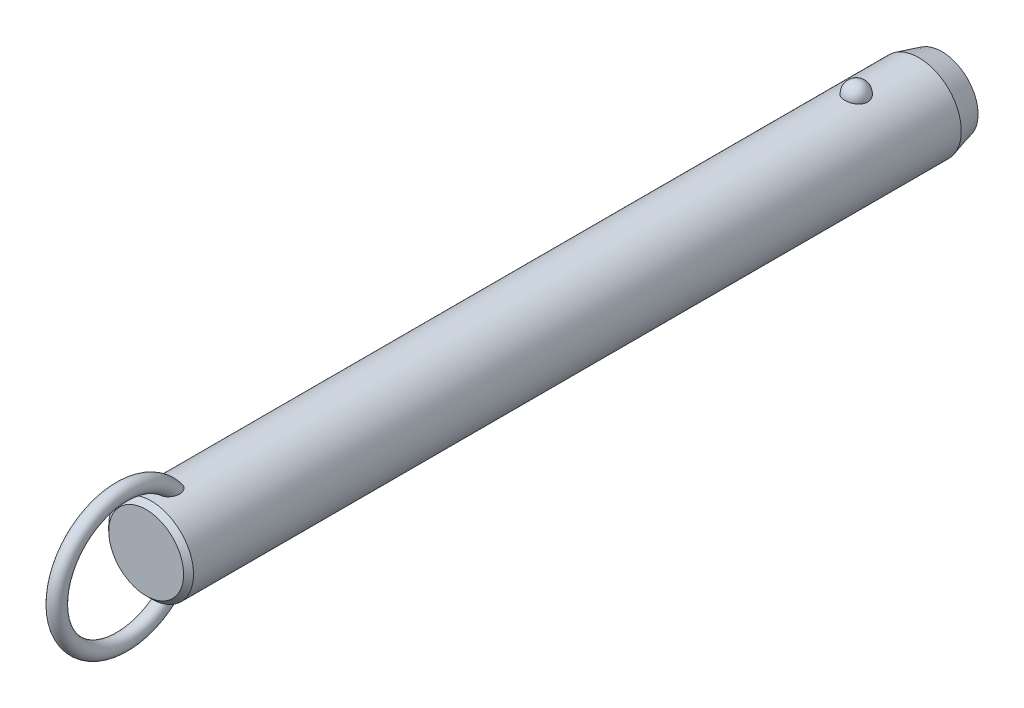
ISO-10303-21;
HEADER;
FILE_DESCRIPTION(('STEP AP214'),'2;1');
FILE_NAME('part.step','',(''),(''),'','','');
FILE_SCHEMA(('AUTOMOTIVE_DESIGN { 1 0 10303 214 1 1 1 1 }'));
ENDSEC;
DATA;
#1=APPLICATION_CONTEXT('core data for automotive mechanical design processes');
#2=APPLICATION_PROTOCOL_DEFINITION('international standard','automotive_design',2000,#1);
#3=PRODUCT_CONTEXT('',#1,'mechanical');
#4=PRODUCT('Part','Part','',(#3));
#5=PRODUCT_RELATED_PRODUCT_CATEGORY('part','',(#4));
#6=PRODUCT_DEFINITION_FORMATION('','',#4);
#7=PRODUCT_DEFINITION_CONTEXT('part definition',#1,'design');
#8=PRODUCT_DEFINITION('design','',#6,#7);
#9=PRODUCT_DEFINITION_SHAPE('','',#8);
#10=(LENGTH_UNIT() NAMED_UNIT(*) SI_UNIT(.MILLI.,.METRE.));
#11=(NAMED_UNIT(*) PLANE_ANGLE_UNIT() SI_UNIT($,.RADIAN.));
#12=(NAMED_UNIT(*) SI_UNIT($,.STERADIAN.) SOLID_ANGLE_UNIT());
#13=UNCERTAINTY_MEASURE_WITH_UNIT(LENGTH_MEASURE(1.E-05),#10,'distance_accuracy_value','');
#14=(GEOMETRIC_REPRESENTATION_CONTEXT(3) GLOBAL_UNCERTAINTY_ASSIGNED_CONTEXT((#13)) GLOBAL_UNIT_ASSIGNED_CONTEXT((#10,
#11,#12)) REPRESENTATION_CONTEXT('',''));
#15=CARTESIAN_POINT('',(0.,0.,0.));
#16=DIRECTION('',(0.,0.,1.));
#17=DIRECTION('',(1.,0.,0.));
#18=AXIS2_PLACEMENT_3D('',#15,#16,#17);
#19=CARTESIAN_POINT('',(0.,0.,170.2));
#20=DIRECTION('',(0.,0.,-1.));
#21=DIRECTION('',(-1.,0.,0.));
#22=AXIS2_PLACEMENT_3D('',#19,#20,#21);
#23=CYLINDRICAL_SURFACE('',#22,11.1);
#24=CARTESIAN_POINT('',(2.9724815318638,10.6945945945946,-3.00000000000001));
#25=CARTESIAN_POINT('',(2.97247830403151,10.6945972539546,-2.8322505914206));
#26=CARTESIAN_POINT('',(2.95876598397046,10.6984356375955,-2.66445972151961));
#27=CARTESIAN_POINT('',(2.90424529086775,10.7133624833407,-2.3336238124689));
#28=CARTESIAN_POINT('',(2.8634252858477,10.7244540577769,-2.17058084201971));
#29=CARTESIAN_POINT('',(2.75573657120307,10.7526272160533,-1.85396767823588));
#30=CARTESIAN_POINT('',(2.68887937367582,10.7697061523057,-1.70039333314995));
#31=CARTESIAN_POINT('',(2.53079696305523,10.8079438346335,-1.4069159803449));
#32=CARTESIAN_POINT('',(2.43957264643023,10.8291024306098,-1.26701246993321));
#33=CARTESIAN_POINT('',(2.23458150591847,10.8732541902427,-1.00409565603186));
#34=CARTESIAN_POINT('',(2.12071295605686,10.8962553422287,-0.881162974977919));
#35=CARTESIAN_POINT('',(1.87365402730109,10.9414421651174,-0.656352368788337));
#36=CARTESIAN_POINT('',(1.74046358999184,10.9636278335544,-0.554474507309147));
#37=CARTESIAN_POINT('',(1.45872188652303,11.0046495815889,-0.374872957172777));
#38=CARTESIAN_POINT('',(1.31021276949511,11.0234944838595,-0.297085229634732));
#39=CARTESIAN_POINT('',(1.00170030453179,11.0557957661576,-0.167529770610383));
#40=CARTESIAN_POINT('',(0.841698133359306,11.0692526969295,-0.1157593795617));
#41=CARTESIAN_POINT('',(0.517607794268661,11.0890932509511,-0.0403925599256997));
#42=CARTESIAN_POINT('',(0.353633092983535,11.0955916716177,-0.0163383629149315));
#43=CARTESIAN_POINT('',(0.0238420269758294,11.1011989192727,0.00445177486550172));
#44=CARTESIAN_POINT('',(-0.141974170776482,11.1003084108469,0.00119017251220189));
#45=CARTESIAN_POINT('',(-0.468405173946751,11.0912990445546,-0.0323233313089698));
#46=CARTESIAN_POINT('',(-0.629059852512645,11.0832767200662,-0.062214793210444));
#47=CARTESIAN_POINT('',(-0.942937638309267,11.0609962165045,-0.147645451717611));
#48=CARTESIAN_POINT('',(-1.09616062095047,11.0467379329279,-0.203185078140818));
#49=CARTESIAN_POINT('',(-1.39181061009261,11.0134071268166,-0.338752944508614));
#50=CARTESIAN_POINT('',(-1.53417383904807,10.9943086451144,-0.418913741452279));
#51=CARTESIAN_POINT('',(-1.80342160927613,10.9533667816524,-0.601448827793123));
#52=CARTESIAN_POINT('',(-1.9303046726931,10.9315231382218,-0.703825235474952));
#53=CARTESIAN_POINT('',(-2.16747598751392,10.887005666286,-0.930091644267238));
#54=CARTESIAN_POINT('',(-2.27742774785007,10.8643239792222,-1.05433291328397));
#55=CARTESIAN_POINT('',(-2.47517316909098,10.8209886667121,-1.31966633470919));
#56=CARTESIAN_POINT('',(-2.56296538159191,10.8003351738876,-1.46075958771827));
#57=CARTESIAN_POINT('',(-2.71500300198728,10.7631304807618,-1.75753646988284));
#58=CARTESIAN_POINT('',(-2.77898901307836,10.7466250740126,-1.91335887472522));
#59=CARTESIAN_POINT('',(-2.88046189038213,10.7198747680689,-2.23391529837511));
#60=CARTESIAN_POINT('',(-2.91794947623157,10.709629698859,-2.3986490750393));
#61=CARTESIAN_POINT('',(-2.96537819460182,10.6965949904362,-2.73165170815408));
#62=CARTESIAN_POINT('',(-2.97542891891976,10.693775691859,-2.89990378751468));
#63=CARTESIAN_POINT('',(-2.96804271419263,10.6958279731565,-3.23575286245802));
#64=CARTESIAN_POINT('',(-2.95060646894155,10.7006993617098,-3.4033498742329));
#65=CARTESIAN_POINT('',(-2.88883358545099,10.71753912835,-3.73233906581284));
#66=CARTESIAN_POINT('',(-2.84462026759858,10.7294749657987,-3.89375610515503));
#67=CARTESIAN_POINT('',(-2.73050447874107,10.7590797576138,-4.20667949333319));
#68=CARTESIAN_POINT('',(-2.66060103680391,10.7767489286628,-4.35818546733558));
#69=CARTESIAN_POINT('',(-2.49642559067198,10.8159599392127,-4.64785421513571));
#70=CARTESIAN_POINT('',(-2.40203047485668,10.8375211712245,-4.78594458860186));
#71=CARTESIAN_POINT('',(-2.19143488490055,10.8820570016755,-5.04410382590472));
#72=CARTESIAN_POINT('',(-2.07523364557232,10.9050316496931,-5.16417205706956));
#73=CARTESIAN_POINT('',(-1.82361254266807,10.9499219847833,-5.3833483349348));
#74=CARTESIAN_POINT('',(-1.68812945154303,10.9718338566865,-5.48238464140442));
#75=CARTESIAN_POINT('',(-1.40191298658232,11.0120611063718,-5.65618873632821));
#76=CARTESIAN_POINT('',(-1.25118062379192,11.0303767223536,-5.73095813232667));
#77=CARTESIAN_POINT('',(-0.940570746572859,11.0611653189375,-5.85334725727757));
#78=CARTESIAN_POINT('',(-0.780821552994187,11.0737044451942,-5.90127578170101));
#79=CARTESIAN_POINT('',(-0.455204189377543,11.0918598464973,-5.96992976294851));
#80=CARTESIAN_POINT('',(-0.289336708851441,11.0974768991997,-5.99065827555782));
#81=CARTESIAN_POINT('',(0.0406846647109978,11.1011307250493,-6.00418773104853));
#82=CARTESIAN_POINT('',(0.204817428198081,11.099299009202,-5.9974731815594));
#83=CARTESIAN_POINT('',(0.5295530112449,11.088551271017,-5.95740317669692));
#84=CARTESIAN_POINT('',(0.69015594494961,11.0796354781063,-5.92404858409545));
#85=CARTESIAN_POINT('',(1.0027760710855,11.0557204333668,-5.83180084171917));
#86=CARTESIAN_POINT('',(1.15482001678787,11.0407414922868,-5.7729929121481));
#87=CARTESIAN_POINT('',(1.44678373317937,11.0062913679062,-5.63147366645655));
#88=CARTESIAN_POINT('',(1.58670279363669,10.9868199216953,-5.54876095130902));
#89=CARTESIAN_POINT('',(1.8527023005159,10.9451315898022,-5.36027644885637));
#90=CARTESIAN_POINT('',(1.97855158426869,10.9228788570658,-5.25418644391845));
#91=CARTESIAN_POINT('',(2.21080872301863,10.8782509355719,-5.02251354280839));
#92=CARTESIAN_POINT('',(2.31721312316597,10.8558757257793,-4.89692718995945));
#93=CARTESIAN_POINT('',(2.5094551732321,10.8130715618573,-4.62745408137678));
#94=CARTESIAN_POINT('',(2.59493284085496,10.7926798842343,-4.48330448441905));
#95=CARTESIAN_POINT('',(2.740862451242,10.7565495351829,-4.18236358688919));
#96=CARTESIAN_POINT('',(2.80132490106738,10.7408089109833,-4.02557762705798));
#97=CARTESIAN_POINT('',(2.88959070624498,10.7173718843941,-3.72475308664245));
#98=CARTESIAN_POINT('',(2.92062102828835,10.7088950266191,-3.58171216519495));
#99=CARTESIAN_POINT('',(2.96206765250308,10.6975052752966,-3.29245795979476));
#100=CARTESIAN_POINT('',(2.97248434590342,10.6945922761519,-3.14624473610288));
#101=CARTESIAN_POINT('',(2.9724815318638,10.6945945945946,-3.00000000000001));
#102=B_SPLINE_CURVE_WITH_KNOTS('',3,(#24,#25,#26,#27,#28,#29,#30,#31,#32,#33,#34,#35,#36,#37,
#38,#39,#40,#41,#42,#43,#44,#45,#46,#47,#48,#49,#50,#51,#52,#53,#54,#55,#56,#57,#58,#59,#60,#61,
#62,#63,#64,#65,#66,#67,#68,#69,#70,#71,#72,#73,#74,#75,#76,#77,#78,#79,#80,#81,#82,#83,#84,#85,
#86,#87,#88,#89,#90,#91,#92,#93,#94,#95,#96,#97,#98,#99,#100,#101),.UNSPECIFIED.,.T.,.F.,(4,2,2,
2,2,2,2,2,2,2,2,2,2,2,2,2,2,2,2,2,2,2,2,2,2,2,2,2,2,2,2,2,2,2,2,2,2,2,4),(0.,0.502722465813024,
1.00566079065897,1.5083769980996,2.01107471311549,2.51608392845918,3.02109467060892,
3.52475118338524,4.02835620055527,4.523518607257,5.0186364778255,5.50715297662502,
5.9956776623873,6.48688002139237,6.97812923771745,7.47814366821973,7.9781907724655,
8.48353712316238,8.9888697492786,9.49218093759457,9.99547960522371,10.4964777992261,
10.997494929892,11.5010810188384,12.0046847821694,12.5099796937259,13.0152411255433,
13.5145635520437,14.0138298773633,14.5043200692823,14.9947943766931,15.4836390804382,
15.9725123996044,16.4685040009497,16.9645836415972,17.4686765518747,17.972557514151,
18.410841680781,18.849117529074),.UNSPECIFIED.);
#103=CARTESIAN_POINT('',(2.9724815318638,10.6945945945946,-3.00000000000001));
#104=VERTEX_POINT('',#103);
#105=EDGE_CURVE('E41',#104,#104,#102,.T.);
#106=ORIENTED_EDGE('',*,*,#105,.T.);
#107=EDGE_LOOP('',(#106));
#108=FACE_BOUND('',#107,.T.);
#109=CARTESIAN_POINT('',(0.,0.,181.6));
#110=DIRECTION('',(0.,0.,1.));
#111=DIRECTION('',(1.,0.,0.));
#112=AXIS2_PLACEMENT_3D('',#109,#110,#111);
#113=CIRCLE('',#112,11.1);
#114=CARTESIAN_POINT('',(-11.1,0.,181.6));
#115=VERTEX_POINT('',#114);
#116=EDGE_CURVE('E10',#115,#115,#113,.F.);
#117=ORIENTED_EDGE('',*,*,#116,.T.);
#118=EDGE_LOOP('',(#117));
#119=FACE_BOUND('',#118,.T.);
#120=CARTESIAN_POINT('',(-0.564520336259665,-11.0856356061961,173.857815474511));
#121=CARTESIAN_POINT('',(-0.667202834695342,-11.0804062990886,173.891283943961));
#122=CARTESIAN_POINT('',(-0.766875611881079,-11.0738877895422,173.933835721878));
#123=CARTESIAN_POINT('',(-0.957284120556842,-11.0590576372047,174.035419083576));
#124=CARTESIAN_POINT('',(-1.04801616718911,-11.0507452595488,174.09445742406));
#125=CARTESIAN_POINT('',(-1.21800952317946,-11.0333016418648,174.226529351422));
#126=CARTESIAN_POINT('',(-1.29730805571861,-11.0241732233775,174.299515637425));
#127=CARTESIAN_POINT('',(-1.44337665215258,-11.0060026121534,174.457037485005));
#128=CARTESIAN_POINT('',(-1.51014622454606,-10.9969604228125,174.541573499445));
#129=CARTESIAN_POINT('',(-1.63454620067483,-10.9791841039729,174.725521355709));
#130=CARTESIAN_POINT('',(-1.69127003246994,-10.9705107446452,174.825549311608));
#131=CARTESIAN_POINT('',(-1.7898078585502,-10.9548648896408,175.032790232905));
#132=CARTESIAN_POINT('',(-1.83161214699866,-10.9478935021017,175.140007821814));
#133=CARTESIAN_POINT('',(-1.91557028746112,-10.9335803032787,175.405408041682));
#134=CARTESIAN_POINT('',(-1.95040620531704,-10.9273269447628,175.565980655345));
#135=CARTESIAN_POINT('',(-1.99388326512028,-10.9194709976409,175.890697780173));
#136=CARTESIAN_POINT('',(-2.00248051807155,-10.9178762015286,176.054847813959));
#137=CARTESIAN_POINT('',(-1.99551615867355,-10.9191578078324,176.424650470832));
#138=CARTESIAN_POINT('',(-1.97322066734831,-10.9232807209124,176.630191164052));
#139=CARTESIAN_POINT('',(-1.91529761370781,-10.9335244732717,176.933595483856));
#140=CARTESIAN_POINT('',(-1.89184575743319,-10.9376266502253,177.034088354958));
#141=CARTESIAN_POINT('',(-1.83700674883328,-10.9469720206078,177.232855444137));
#142=CARTESIAN_POINT('',(-1.80562070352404,-10.9522150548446,177.331129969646));
#143=CARTESIAN_POINT('',(-1.73463055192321,-10.9636837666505,177.525914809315));
#144=CARTESIAN_POINT('',(-1.69493416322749,-10.9699202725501,177.622390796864));
#145=CARTESIAN_POINT('',(-1.60745141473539,-10.9830806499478,177.811626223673));
#146=CARTESIAN_POINT('',(-1.55966150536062,-10.9900048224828,177.904384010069));
#147=CARTESIAN_POINT('',(-1.45591812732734,-11.0042280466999,178.084690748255));
#148=CARTESIAN_POINT('',(-1.40000013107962,-11.0115253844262,178.172260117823));
#149=CARTESIAN_POINT('',(-1.27937470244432,-11.0261911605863,178.341029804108));
#150=CARTESIAN_POINT('',(-1.21467835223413,-11.0335594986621,178.42223795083));
#151=CARTESIAN_POINT('',(-1.08218150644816,-11.0473027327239,178.569001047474));
#152=CARTESIAN_POINT('',(-1.01522633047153,-11.0537063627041,178.635309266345));
#153=CARTESIAN_POINT('',(-0.872952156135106,-11.065850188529,178.758378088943));
#154=CARTESIAN_POINT('',(-0.797642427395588,-11.0715911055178,178.815149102));
#155=CARTESIAN_POINT('',(-0.651396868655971,-11.081071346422,178.907515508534));
#156=CARTESIAN_POINT('',(-0.581712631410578,-11.0849841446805,178.945049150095));
#157=CARTESIAN_POINT('',(-0.437066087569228,-11.0916271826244,179.008259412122));
#158=CARTESIAN_POINT('',(-0.362109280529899,-11.0943586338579,179.033948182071));
#159=CARTESIAN_POINT('',(-0.207828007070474,-11.0983242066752,179.071117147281));
#160=CARTESIAN_POINT('',(-0.12846771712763,-11.0995432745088,179.082454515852));
#161=CARTESIAN_POINT('',(0.0309101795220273,-11.1002423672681,179.088965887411));
#162=CARTESIAN_POINT('',(0.110927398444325,-11.0997233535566,179.084148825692));
#163=CARTESIAN_POINT('',(0.25640659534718,-11.097240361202,179.060959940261));
#164=CARTESIAN_POINT('',(0.322235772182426,-11.0955074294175,179.044754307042));
#165=CARTESIAN_POINT('',(0.450635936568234,-11.0910350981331,179.002600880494));
#166=CARTESIAN_POINT('',(0.513205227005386,-11.0882951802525,178.976648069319));
#167=CARTESIAN_POINT('',(0.662626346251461,-11.0805620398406,178.902607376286));
#168=CARTESIAN_POINT('',(0.747127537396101,-11.0751144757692,178.849845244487));
#169=CARTESIAN_POINT('',(0.906756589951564,-11.0631932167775,178.731720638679));
#170=CARTESIAN_POINT('',(0.981859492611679,-11.0567168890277,178.666325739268));
#171=CARTESIAN_POINT('',(1.10712207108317,-11.0447856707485,178.54226337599));
#172=CARTESIAN_POINT('',(1.15909566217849,-11.0394280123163,178.485383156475));
#173=CARTESIAN_POINT('',(1.25791923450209,-11.0286040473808,178.367327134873));
#174=CARTESIAN_POINT('',(1.30476642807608,-11.0231376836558,178.306149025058));
#175=CARTESIAN_POINT('',(1.43818612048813,-11.0068027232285,178.117305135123));
#176=CARTESIAN_POINT('',(1.51751767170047,-10.9960104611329,177.984453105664));
#177=CARTESIAN_POINT('',(1.63597546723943,-10.9788847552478,177.753137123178));
#178=CARTESIAN_POINT('',(1.67988876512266,-10.9722190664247,177.657053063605));
#179=CARTESIAN_POINT('',(1.75953241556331,-10.9597298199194,177.461431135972));
#180=CARTESIAN_POINT('',(1.79525967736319,-10.9539065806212,177.361891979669));
#181=CARTESIAN_POINT('',(1.85844731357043,-10.9433632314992,177.16021118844));
#182=CARTESIAN_POINT('',(1.88591073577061,-10.9386427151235,177.05807052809));
#183=CARTESIAN_POINT('',(1.93234324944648,-10.9305350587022,176.851819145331));
#184=CARTESIAN_POINT('',(1.95131065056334,-10.9271481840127,176.747708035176));
#185=CARTESIAN_POINT('',(1.99040203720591,-10.9201183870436,176.465458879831));
#186=CARTESIAN_POINT('',(2.00221217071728,-10.9179256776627,176.286037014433));
#187=CARTESIAN_POINT('',(1.99711676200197,-10.9188636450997,175.927713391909));
#188=CARTESIAN_POINT('',(1.98026150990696,-10.9219849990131,175.748811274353));
#189=CARTESIAN_POINT('',(1.92151657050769,-10.9324473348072,175.43645144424));
#190=CARTESIAN_POINT('',(1.88605081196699,-10.9386915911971,175.301759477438));
#191=CARTESIAN_POINT('',(1.79393020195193,-10.9541780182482,175.039966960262));
#192=CARTESIAN_POINT('',(1.73729868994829,-10.9634168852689,174.912858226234));
#193=CARTESIAN_POINT('',(1.61237037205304,-10.9824218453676,174.689418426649));
#194=CARTESIAN_POINT('',(1.54715374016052,-10.9918945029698,174.591345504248));
#195=CARTESIAN_POINT('',(1.40127026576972,-11.0114415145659,174.407434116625));
#196=CARTESIAN_POINT('',(1.32060742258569,-11.0215157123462,174.321592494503));
#197=CARTESIAN_POINT('',(1.1447478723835,-11.041168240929,174.165163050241));
#198=CARTESIAN_POINT('',(1.04947805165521,-11.0507437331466,174.094656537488));
#199=CARTESIAN_POINT('',(0.847278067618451,-11.0680789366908,173.972640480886));
#200=CARTESIAN_POINT('',(0.740351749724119,-11.0758392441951,173.921124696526));
#201=CARTESIAN_POINT('',(0.529289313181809,-11.0878275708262,173.843485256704));
#202=CARTESIAN_POINT('',(0.425895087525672,-11.0923259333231,173.815377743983));
#203=CARTESIAN_POINT('',(0.215723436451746,-11.0984001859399,173.777703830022));
#204=CARTESIAN_POINT('',(0.10894793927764,-11.0999777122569,173.768127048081));
#205=CARTESIAN_POINT('',(-0.0938962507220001,-11.1000196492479,173.767877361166));
#206=CARTESIAN_POINT('',(-0.189967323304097,-11.0987797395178,173.775408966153));
#207=CARTESIAN_POINT('',(-0.379657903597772,-11.0939111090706,173.805507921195));
#208=CARTESIAN_POINT('',(-0.473277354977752,-11.0902823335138,173.828075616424));
#209=CARTESIAN_POINT('',(-0.564520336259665,-11.0856356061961,173.857815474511));
#210=B_SPLINE_CURVE_WITH_KNOTS('',3,(#120,#121,#122,#123,#124,#125,#126,#127,#128,#129,#130,
#131,#132,#133,#134,#135,#136,#137,#138,#139,#140,#141,#142,#143,#144,#145,#146,#147,#148,#149,
#150,#151,#152,#153,#154,#155,#156,#157,#158,#159,#160,#161,#162,#163,#164,#165,#166,#167,#168,
#169,#170,#171,#172,#173,#174,#175,#176,#177,#178,#179,#180,#181,#182,#183,#184,#185,#186,#187,
#188,#189,#190,#191,#192,#193,#194,#195,#196,#197,#198,#199,#200,#201,#202,#203,#204,#205,#206,
#207,#208,#209),.UNSPECIFIED.,.T.,.F.,(4,2,2,2,2,2,2,2,2,2,2,2,2,2,2,2,2,2,2,2,2,2,2,2,2,2,2,2,
2,2,2,2,2,2,2,2,2,2,2,2,2,2,2,2,4),(0.,0.323999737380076,0.648132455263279,0.971184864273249,
1.29424994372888,1.63886237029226,1.98369857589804,2.47426059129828,2.96564271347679,
3.58257396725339,3.89215258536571,4.20168803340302,4.51486273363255,4.82817514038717,
5.14015911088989,5.45175282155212,5.73442856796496,6.01679375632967,6.25364580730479,
6.49025437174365,6.72919963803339,6.96801276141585,7.17061258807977,7.37331685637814,
7.67094989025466,7.96935728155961,8.20075067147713,8.43226927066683,8.89581623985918,
9.21306533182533,9.5304340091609,9.84768549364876,10.1650000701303,10.7022930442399,
11.2386443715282,11.655339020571,12.071575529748,12.4245637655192,12.7774607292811,
13.1321855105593,13.4867936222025,13.8068771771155,14.1267813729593,14.4146787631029,
14.7025827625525),.UNSPECIFIED.);
#211=CARTESIAN_POINT('',(-0.564520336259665,-11.0856356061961,173.857815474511));
#212=VERTEX_POINT('',#211);
#213=EDGE_CURVE('E58',#212,#212,#210,.T.);
#214=ORIENTED_EDGE('',*,*,#213,.T.);
#215=EDGE_LOOP('',(#214));
#216=FACE_BOUND('',#215,.T.);
#217=CARTESIAN_POINT('',(-0.564520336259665,11.0856356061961,173.857815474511));
#218=CARTESIAN_POINT('',(-0.468542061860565,11.0905203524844,173.826545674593));
#219=CARTESIAN_POINT('',(-0.369793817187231,11.0942886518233,173.803157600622));
#220=CARTESIAN_POINT('',(-0.169555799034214,11.0991586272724,173.773085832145));
#221=CARTESIAN_POINT('',(-0.0680604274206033,11.1002543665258,173.76643932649));
#222=CARTESIAN_POINT('',(0.13454973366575,11.099646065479,173.770157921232));
#223=CARTESIAN_POINT('',(0.235664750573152,11.0979441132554,173.78051033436));
#224=CARTESIAN_POINT('',(0.434632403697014,11.0919342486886,173.817831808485));
#225=CARTESIAN_POINT('',(0.532486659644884,11.0876276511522,173.844792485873));
#226=CARTESIAN_POINT('',(0.722445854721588,11.0768742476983,173.9144096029));
#227=CARTESIAN_POINT('',(0.814543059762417,11.0704246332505,173.957086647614));
#228=CARTESIAN_POINT('',(0.990565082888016,11.0560659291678,174.056648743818));
#229=CARTESIAN_POINT('',(1.07448844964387,11.048156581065,174.113536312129));
#230=CARTESIAN_POINT('',(1.23562672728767,11.0313221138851,174.242210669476));
#231=CARTESIAN_POINT('',(1.3124268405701,11.0223686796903,174.314511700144));
#232=CARTESIAN_POINT('',(1.45398030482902,11.0045918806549,174.470042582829));
#233=CARTESIAN_POINT('',(1.51873073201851,10.9957685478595,174.553275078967));
#234=CARTESIAN_POINT('',(1.64107232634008,10.9782087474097,174.736384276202));
#235=CARTESIAN_POINT('',(1.6974317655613,10.9695572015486,174.837089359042));
#236=CARTESIAN_POINT('',(1.79515063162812,10.9539887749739,175.045626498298));
#237=CARTESIAN_POINT('',(1.83649966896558,10.9470730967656,175.15346343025));
#238=CARTESIAN_POINT('',(1.91931148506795,10.9329211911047,175.420399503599));
#239=CARTESIAN_POINT('',(1.95340104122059,10.9267904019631,175.581861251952));
#240=CARTESIAN_POINT('',(1.99526195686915,10.9192174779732,175.90821631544));
#241=CARTESIAN_POINT('',(2.00298989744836,10.9177830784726,176.07311484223));
#242=CARTESIAN_POINT('',(1.99396251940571,10.9194420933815,176.444100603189));
#243=CARTESIAN_POINT('',(1.97050829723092,10.923774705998,176.65003871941));
#244=CARTESIAN_POINT('',(1.91079643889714,10.9343131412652,176.953901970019));
#245=CARTESIAN_POINT('',(1.88673702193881,10.9385106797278,177.054529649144));
#246=CARTESIAN_POINT('',(1.8306550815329,10.9480376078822,177.253510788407));
#247=CARTESIAN_POINT('',(1.79863369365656,10.9533668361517,177.351864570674));
#248=CARTESIAN_POINT('',(1.72633365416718,10.9649954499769,177.546720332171));
#249=CARTESIAN_POINT('',(1.68596409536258,10.9713053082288,177.64318790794));
#250=CARTESIAN_POINT('',(1.59707998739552,10.9845964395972,177.832323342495));
#251=CARTESIAN_POINT('',(1.54856169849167,10.9915780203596,177.924989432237));
#252=CARTESIAN_POINT('',(1.44330168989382,11.0058935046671,178.104975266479));
#253=CARTESIAN_POINT('',(1.3865974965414,11.0132257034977,178.192316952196));
#254=CARTESIAN_POINT('',(1.2643115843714,11.0279330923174,178.360456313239));
#255=CARTESIAN_POINT('',(1.19874160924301,11.0353082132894,178.441262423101));
#256=CARTESIAN_POINT('',(1.06542088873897,11.048931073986,178.585985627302));
#257=CARTESIAN_POINT('',(0.998640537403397,11.0552153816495,178.650784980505));
#258=CARTESIAN_POINT('',(0.856896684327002,11.0671032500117,178.770846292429));
#259=CARTESIAN_POINT('',(0.781942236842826,11.0727075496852,178.826118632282));
#260=CARTESIAN_POINT('',(0.636276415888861,11.081949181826,178.915972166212));
#261=CARTESIAN_POINT('',(0.566755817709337,11.0857572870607,178.952441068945));
#262=CARTESIAN_POINT('',(0.422602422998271,11.0921860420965,179.013533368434));
#263=CARTESIAN_POINT('',(0.347974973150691,11.0948079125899,179.038168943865));
#264=CARTESIAN_POINT('',(0.194593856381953,11.0985608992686,179.073323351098));
#265=CARTESIAN_POINT('',(0.115807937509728,11.0996777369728,179.083706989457));
#266=CARTESIAN_POINT('',(-0.0422499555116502,11.1002003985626,179.088574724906));
#267=CARTESIAN_POINT('',(-0.121521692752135,11.09960699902,179.083066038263));
#268=CARTESIAN_POINT('',(-0.266046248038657,11.0970123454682,179.058827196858));
#269=CARTESIAN_POINT('',(-0.331661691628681,11.0952283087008,179.042135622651));
#270=CARTESIAN_POINT('',(-0.45958809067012,11.0906663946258,178.999111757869));
#271=CARTESIAN_POINT('',(-0.52189737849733,11.0878880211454,178.972774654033));
#272=CARTESIAN_POINT('',(-0.671446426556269,11.0800342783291,178.897513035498));
#273=CARTESIAN_POINT('',(-0.756250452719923,11.0744969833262,178.843818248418));
#274=CARTESIAN_POINT('',(-0.916349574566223,11.0624045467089,178.723802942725));
#275=CARTESIAN_POINT('',(-0.991618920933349,11.0558467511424,178.657449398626));
#276=CARTESIAN_POINT('',(-1.11713140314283,11.0437783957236,178.531633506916));
#277=CARTESIAN_POINT('',(-1.16920539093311,11.0383619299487,178.473952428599));
#278=CARTESIAN_POINT('',(-1.26817476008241,11.02743010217,178.354280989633));
#279=CARTESIAN_POINT('',(-1.31506731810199,11.0219146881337,178.292288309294));
#280=CARTESIAN_POINT('',(-1.40399813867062,11.0109399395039,178.164784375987));
#281=CARTESIAN_POINT('',(-1.44602864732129,11.0054807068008,178.099267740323));
#282=CARTESIAN_POINT('',(-1.52538779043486,10.9947621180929,177.965422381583));
#283=CARTESIAN_POINT('',(-1.56271516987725,10.9895028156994,177.897092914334));
#284=CARTESIAN_POINT('',(-1.64537943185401,10.9774790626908,177.733210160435));
#285=CARTESIAN_POINT('',(-1.68879497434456,10.9708503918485,177.6366735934));
#286=CARTESIAN_POINT('',(-1.76740738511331,10.9584602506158,177.440236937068));
#287=CARTESIAN_POINT('',(-1.80260120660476,10.95269910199,177.34033561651));
#288=CARTESIAN_POINT('',(-1.86468657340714,10.9423003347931,177.137966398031));
#289=CARTESIAN_POINT('',(-1.8915816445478,10.9376622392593,177.035499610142));
#290=CARTESIAN_POINT('',(-1.93682458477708,10.9297405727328,176.828642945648));
#291=CARTESIAN_POINT('',(-1.95517082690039,10.9264572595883,176.724252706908));
#292=CARTESIAN_POINT('',(-1.99232562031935,10.9197647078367,176.44262876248));
#293=CARTESIAN_POINT('',(-2.00294603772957,10.9177914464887,176.264185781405));
#294=CARTESIAN_POINT('',(-1.99566675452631,10.9191290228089,175.907996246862));
#295=CARTESIAN_POINT('',(-1.97781651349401,10.9224306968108,175.73024902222));
#296=CARTESIAN_POINT('',(-1.91747214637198,10.9331592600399,175.419792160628));
#297=CARTESIAN_POINT('',(-1.88131022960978,10.9395108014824,175.285825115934));
#298=CARTESIAN_POINT('',(-1.78790380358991,10.9551659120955,175.02559757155));
#299=CARTESIAN_POINT('',(-1.7306830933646,10.9644661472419,174.899328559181));
#300=CARTESIAN_POINT('',(-1.60475573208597,10.9835398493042,174.67741565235));
#301=CARTESIAN_POINT('',(-1.53908879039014,10.9930297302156,174.580026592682));
#302=CARTESIAN_POINT('',(-1.39238608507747,11.0125708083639,174.397525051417));
#303=CARTESIAN_POINT('',(-1.31135150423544,11.0226219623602,174.312411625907));
#304=CARTESIAN_POINT('',(-1.14382035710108,11.0411991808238,174.16529943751));
#305=CARTESIAN_POINT('',(-1.0585850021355,11.0497792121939,174.10186930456));
#306=CARTESIAN_POINT('',(-0.878723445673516,11.0655285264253,173.990250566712));
#307=CARTESIAN_POINT('',(-0.784123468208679,11.0727015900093,173.942020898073));
#308=CARTESIAN_POINT('',(-0.646163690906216,11.0812501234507,173.886023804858));
#309=CARTESIAN_POINT('',(-0.605595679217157,11.0835451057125,173.871197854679));
#310=CARTESIAN_POINT('',(-0.564520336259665,11.0856356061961,173.857815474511));
#311=B_SPLINE_CURVE_WITH_KNOTS('',3,(#217,#218,#219,#220,#221,#222,#223,#224,#225,#226,#227,
#228,#229,#230,#231,#232,#233,#234,#235,#236,#237,#238,#239,#240,#241,#242,#243,#244,#245,#246,
#247,#248,#249,#250,#251,#252,#253,#254,#255,#256,#257,#258,#259,#260,#261,#262,#263,#264,#265,
#266,#267,#268,#269,#270,#271,#272,#273,#274,#275,#276,#277,#278,#279,#280,#281,#282,#283,#284,
#285,#286,#287,#288,#289,#290,#291,#292,#293,#294,#295,#296,#297,#298,#299,#300,#301,#302,#303,
#304,#305,#306,#307,#308,#309,#310),.UNSPECIFIED.,.T.,.F.,(4,2,2,2,2,2,2,2,2,2,2,2,2,2,2,2,2,2,
2,2,2,2,2,2,2,2,2,2,2,2,2,2,2,2,2,2,2,2,2,2,2,2,2,2,2,2,4),(0.,0.303061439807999,
0.606795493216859,0.910302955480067,1.21365733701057,1.51741085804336,1.82121821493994,
2.13745205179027,2.45376252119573,2.79958678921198,3.14564996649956,3.63832391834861,
4.13180893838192,4.75031912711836,5.06071926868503,5.37107516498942,5.68500772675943,
5.99908475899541,6.31176519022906,6.62403542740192,6.90315673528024,7.18197194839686,
7.41687778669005,7.65154134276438,7.88841587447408,8.12518286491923,8.32752842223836,
8.52997509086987,8.82986421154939,9.13054668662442,9.36393502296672,9.59744991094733,
9.83133221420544,10.0652767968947,10.3830324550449,10.7009056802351,11.0186436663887,
11.3364420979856,11.8705925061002,12.4038159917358,12.8189662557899,13.2336487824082,
13.5857049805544,13.9377340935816,14.2561354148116,14.5736690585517,14.7033687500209),.UNSPECIFIED.);
#312=CARTESIAN_POINT('',(-0.564520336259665,11.0856356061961,173.857815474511));
#313=VERTEX_POINT('',#312);
#314=EDGE_CURVE('E66',#313,#313,#311,.T.);
#315=ORIENTED_EDGE('',*,*,#314,.T.);
#316=EDGE_LOOP('',(#315));
#317=FACE_BOUND('',#316,.T.);
#318=CARTESIAN_POINT('',(0.,0.,-19.3999999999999));
#319=DIRECTION('',(0.,0.,-1.));
#320=DIRECTION('',(-1.,0.,0.));
#321=AXIS2_PLACEMENT_3D('',#318,#319,#320);
#322=CIRCLE('',#321,11.1);
#323=CARTESIAN_POINT('',(-11.1,0.,-19.3999999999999));
#324=VERTEX_POINT('',#323);
#325=EDGE_CURVE('E55',#324,#324,#322,.F.);
#326=ORIENTED_EDGE('',*,*,#325,.T.);
#327=EDGE_LOOP('',(#326));
#328=FACE_BOUND('',#327,.T.);
#329=ADVANCED_FACE('F37',(#108,#119,#216,#317,#328),#23,.T.);
#330=CARTESIAN_POINT('',(0.,0.,-25.4));
#331=DIRECTION('',(0.,0.,-1.));
#332=DIRECTION('',(-1.,0.,0.));
#333=AXIS2_PLACEMENT_3D('',#330,#331,#332);
#334=PLANE('',#333);
#335=CARTESIAN_POINT('',(0.,0.,-25.4));
#336=DIRECTION('',(0.,0.,-1.));
#337=DIRECTION('',(-1.,0.,0.));
#338=AXIS2_PLACEMENT_3D('',#335,#336,#337);
#339=CIRCLE('',#338,9.49230484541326);
#340=CARTESIAN_POINT('',(-9.49230484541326,0.,-25.4));
#341=VERTEX_POINT('',#340);
#342=EDGE_CURVE('E65',#341,#341,#339,.T.);
#343=ORIENTED_EDGE('',*,*,#342,.T.);
#344=EDGE_LOOP('',(#343));
#345=FACE_BOUND('',#344,.T.);
#346=ADVANCED_FACE('F84',(#345),#334,.T.);
#347=CARTESIAN_POINT('',(0.,0.,-25.4));
#348=DIRECTION('',(0.,0.,1.));
#349=DIRECTION('',(1.,0.,0.));
#350=AXIS2_PLACEMENT_3D('',#347,#348,#349);
#351=CONICAL_SURFACE('',#350,9.49230484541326,0.261799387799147);
#352=ORIENTED_EDGE('',*,*,#325,.F.);
#353=EDGE_LOOP('',(#352));
#354=FACE_BOUND('',#353,.T.);
#355=ORIENTED_EDGE('',*,*,#342,.F.);
#356=EDGE_LOOP('',(#355));
#357=FACE_BOUND('',#356,.T.);
#358=ADVANCED_FACE('F82',(#354,#357),#351,.T.);
#359=CARTESIAN_POINT('',(0.,0.,182.9));
#360=DIRECTION('',(0.,0.,1.));
#361=DIRECTION('',(1.,0.,0.));
#362=AXIS2_PLACEMENT_3D('',#359,#360,#361);
#363=PLANE('',#362);
#364=CARTESIAN_POINT('',(0.,0.,182.9));
#365=DIRECTION('',(0.,0.,1.));
#366=DIRECTION('',(1.,0.,0.));
#367=AXIS2_PLACEMENT_3D('',#364,#365,#366);
#368=CIRCLE('',#367,9.79999999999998);
#369=CARTESIAN_POINT('',(-9.79999999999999,0.,182.9));
#370=VERTEX_POINT('',#369);
#371=EDGE_CURVE('E50',#370,#370,#368,.T.);
#372=ORIENTED_EDGE('',*,*,#371,.T.);
#373=EDGE_LOOP('',(#372));
#374=FACE_BOUND('',#373,.T.);
#375=ADVANCED_FACE('F76',(#374),#363,.T.);
#376=CARTESIAN_POINT('',(0.,0.,189.25));
#377=DIRECTION('',(1.,0.,0.));
#378=DIRECTION('',(0.,0.,-1.));
#379=AXIS2_PLACEMENT_3D('',#376,#377,#378);
#380=TOROIDAL_SURFACE('',#379,17.05,2.);
#381=ORIENTED_EDGE('',*,*,#314,.F.);
#382=EDGE_LOOP('',(#381));
#383=FACE_BOUND('',#382,.T.);
#384=ORIENTED_EDGE('',*,*,#213,.F.);
#385=EDGE_LOOP('',(#384));
#386=FACE_BOUND('',#385,.T.);
#387=ADVANCED_FACE('F72',(#383,#386),#380,.T.);
#388=CARTESIAN_POINT('',(0.,0.,182.9));
#389=DIRECTION('',(0.,0.,-1.));
#390=DIRECTION('',(-1.,0.,0.));
#391=AXIS2_PLACEMENT_3D('',#388,#389,#390);
#392=CONICAL_SURFACE('',#391,9.79999999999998,0.785398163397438);
#393=CARTESIAN_POINT('',(-11.1,0.,181.6));
#394=CARTESIAN_POINT('',(-11.0864583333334,0.,181.613541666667));
#395=CARTESIAN_POINT('',(-11.0729166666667,0.,181.627083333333));
#396=CARTESIAN_POINT('',(-11.0458333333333,0.,181.654166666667));
#397=CARTESIAN_POINT('',(-11.0322916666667,0.,181.667708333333));
#398=CARTESIAN_POINT('',(-11.0052083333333,0.,181.694791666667));
#399=CARTESIAN_POINT('',(-10.9916666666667,0.,181.708333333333));
#400=CARTESIAN_POINT('',(-10.9645833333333,0.,181.735416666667));
#401=CARTESIAN_POINT('',(-10.9510416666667,0.,181.748958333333));
#402=CARTESIAN_POINT('',(-10.9239583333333,0.,181.776041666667));
#403=CARTESIAN_POINT('',(-10.9104166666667,0.,181.789583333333));
#404=CARTESIAN_POINT('',(-10.8833333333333,0.,181.816666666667));
#405=CARTESIAN_POINT('',(-10.8697916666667,0.,181.830208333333));
#406=CARTESIAN_POINT('',(-10.8427083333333,0.,181.857291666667));
#407=CARTESIAN_POINT('',(-10.8291666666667,0.,181.870833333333));
#408=CARTESIAN_POINT('',(-10.8020833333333,0.,181.897916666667));
#409=CARTESIAN_POINT('',(-10.7885416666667,0.,181.911458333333));
#410=CARTESIAN_POINT('',(-10.7614583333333,0.,181.938541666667));
#411=CARTESIAN_POINT('',(-10.7479166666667,0.,181.952083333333));
#412=CARTESIAN_POINT('',(-10.7208333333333,0.,181.979166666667));
#413=CARTESIAN_POINT('',(-10.7072916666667,0.,181.992708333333));
#414=CARTESIAN_POINT('',(-10.6802083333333,0.,182.019791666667));
#415=CARTESIAN_POINT('',(-10.6666666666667,0.,182.033333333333));
#416=CARTESIAN_POINT('',(-10.6395833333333,0.,182.060416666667));
#417=CARTESIAN_POINT('',(-10.6260416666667,0.,182.073958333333));
#418=CARTESIAN_POINT('',(-10.5989583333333,0.,182.101041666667));
#419=CARTESIAN_POINT('',(-10.5854166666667,0.,182.114583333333));
#420=CARTESIAN_POINT('',(-10.5583333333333,0.,182.141666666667));
#421=CARTESIAN_POINT('',(-10.5447916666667,0.,182.155208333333));
#422=CARTESIAN_POINT('',(-10.5177083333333,0.,182.182291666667));
#423=CARTESIAN_POINT('',(-10.5041666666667,0.,182.195833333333));
#424=CARTESIAN_POINT('',(-10.4770833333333,0.,182.222916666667));
#425=CARTESIAN_POINT('',(-10.4635416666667,0.,182.236458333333));
#426=CARTESIAN_POINT('',(-10.4364583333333,0.,182.263541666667));
#427=CARTESIAN_POINT('',(-10.4229166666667,0.,182.277083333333));
#428=CARTESIAN_POINT('',(-10.3958333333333,0.,182.304166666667));
#429=CARTESIAN_POINT('',(-10.3822916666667,0.,182.317708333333));
#430=CARTESIAN_POINT('',(-10.3552083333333,0.,182.344791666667));
#431=CARTESIAN_POINT('',(-10.3416666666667,0.,182.358333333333));
#432=CARTESIAN_POINT('',(-10.3145833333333,0.,182.385416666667));
#433=CARTESIAN_POINT('',(-10.3010416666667,0.,182.398958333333));
#434=CARTESIAN_POINT('',(-10.2739583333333,0.,182.426041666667));
#435=CARTESIAN_POINT('',(-10.2604166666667,0.,182.439583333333));
#436=CARTESIAN_POINT('',(-10.2333333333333,0.,182.466666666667));
#437=CARTESIAN_POINT('',(-10.2197916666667,0.,182.480208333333));
#438=CARTESIAN_POINT('',(-10.1927083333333,0.,182.507291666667));
#439=CARTESIAN_POINT('',(-10.1791666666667,0.,182.520833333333));
#440=CARTESIAN_POINT('',(-10.1520833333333,0.,182.547916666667));
#441=CARTESIAN_POINT('',(-10.1385416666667,0.,182.561458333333));
#442=CARTESIAN_POINT('',(-10.1114583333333,0.,182.588541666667));
#443=CARTESIAN_POINT('',(-10.0979166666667,0.,182.602083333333));
#444=CARTESIAN_POINT('',(-10.0708333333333,0.,182.629166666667));
#445=CARTESIAN_POINT('',(-10.0572916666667,0.,182.642708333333));
#446=CARTESIAN_POINT('',(-10.0302083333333,0.,182.669791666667));
#447=CARTESIAN_POINT('',(-10.0166666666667,0.,182.683333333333));
#448=CARTESIAN_POINT('',(-9.98958333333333,0.,182.710416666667));
#449=CARTESIAN_POINT('',(-9.97604166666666,0.,182.723958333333));
#450=CARTESIAN_POINT('',(-9.94895833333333,0.,182.751041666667));
#451=CARTESIAN_POINT('',(-9.93541666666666,0.,182.764583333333));
#452=CARTESIAN_POINT('',(-9.90833333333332,0.,182.791666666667));
#453=CARTESIAN_POINT('',(-9.89479166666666,0.,182.805208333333));
#454=CARTESIAN_POINT('',(-9.86770833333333,0.,182.832291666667));
#455=CARTESIAN_POINT('',(-9.85416666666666,0.,182.845833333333));
#456=CARTESIAN_POINT('',(-9.82708333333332,0.,182.872916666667));
#457=CARTESIAN_POINT('',(-9.81354166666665,0.,182.886458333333));
#458=CARTESIAN_POINT('',(-9.79999999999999,0.,182.9));
#459=B_SPLINE_CURVE_WITH_KNOTS('',3,(#393,#394,#395,#396,#397,#398,#399,#400,#401,#402,#403,
#404,#405,#406,#407,#408,#409,#410,#411,#412,#413,#414,#415,#416,#417,#418,#419,#420,#421,#422,
#423,#424,#425,#426,#427,#428,#429,#430,#431,#432,#433,#434,#435,#436,#437,#438,#439,#440,#441,
#442,#443,#444,#445,#446,#447,#448,#449,#450,#451,#452,#453,#454,#455,#456,#457,#458),
.UNSPECIFIED.,.F.,.F.,(4,2,2,2,2,2,2,2,2,2,2,2,2,2,2,2,2,2,2,2,2,2,2,2,2,2,2,2,2,2,2,2,4),(0.,
0.0574524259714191,0.114904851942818,0.172357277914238,0.229809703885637,0.287262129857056,
0.344714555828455,0.402166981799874,0.459619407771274,0.517071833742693,0.574524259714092,
0.631976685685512,0.689429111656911,0.74688153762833,0.80433396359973,0.861786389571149,
0.919238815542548,0.976691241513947,1.03414366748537,1.09159609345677,1.14904851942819,
1.20650094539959,1.263953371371,1.3214057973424,1.37885822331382,1.43631064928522,
1.49376307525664,1.55121550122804,1.60866792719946,1.66612035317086,1.72357277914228,
1.78102520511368,1.8384776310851),.UNSPECIFIED.);
#460=EDGE_CURVE('BSEAM39',#115,#370,#459,.T.);
#461=ORIENTED_EDGE('',*,*,#116,.F.);
#462=ORIENTED_EDGE('',*,*,#371,.F.);
#463=ORIENTED_EDGE('',*,*,#460,.T.);
#464=ORIENTED_EDGE('',*,*,#460,.F.);
#465=EDGE_LOOP('',(#461,#463,#462,#464));
#466=FACE_BOUND('',#465,.T.);
#467=ADVANCED_FACE('F39',(#466),#392,.T.);
#468=CARTESIAN_POINT('',(0.,11.1,-3.00000000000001));
#469=DIRECTION('',(0.,1.,0.));
#470=DIRECTION('',(0.,0.,-1.));
#471=AXIS2_PLACEMENT_3D('',#468,#469,#470);
#472=SPHERICAL_SURFACE('',#471,3.);
#473=ORIENTED_EDGE('',*,*,#105,.F.);
#474=EDGE_LOOP('',(#473));
#475=FACE_BOUND('',#474,.T.);
#476=ADVANCED_FACE('F78',(#475),#472,.T.);
#477=CLOSED_SHELL('',(#329,#346,#358,#375,#387,#467,#476));
#478=MANIFOLD_SOLID_BREP('B2',#477);
#479=ADVANCED_BREP_SHAPE_REPRESENTATION('',(#18,#478),#14);
#480=SHAPE_DEFINITION_REPRESENTATION(#9,#479);
ENDSEC;
END-ISO-10303-21;
